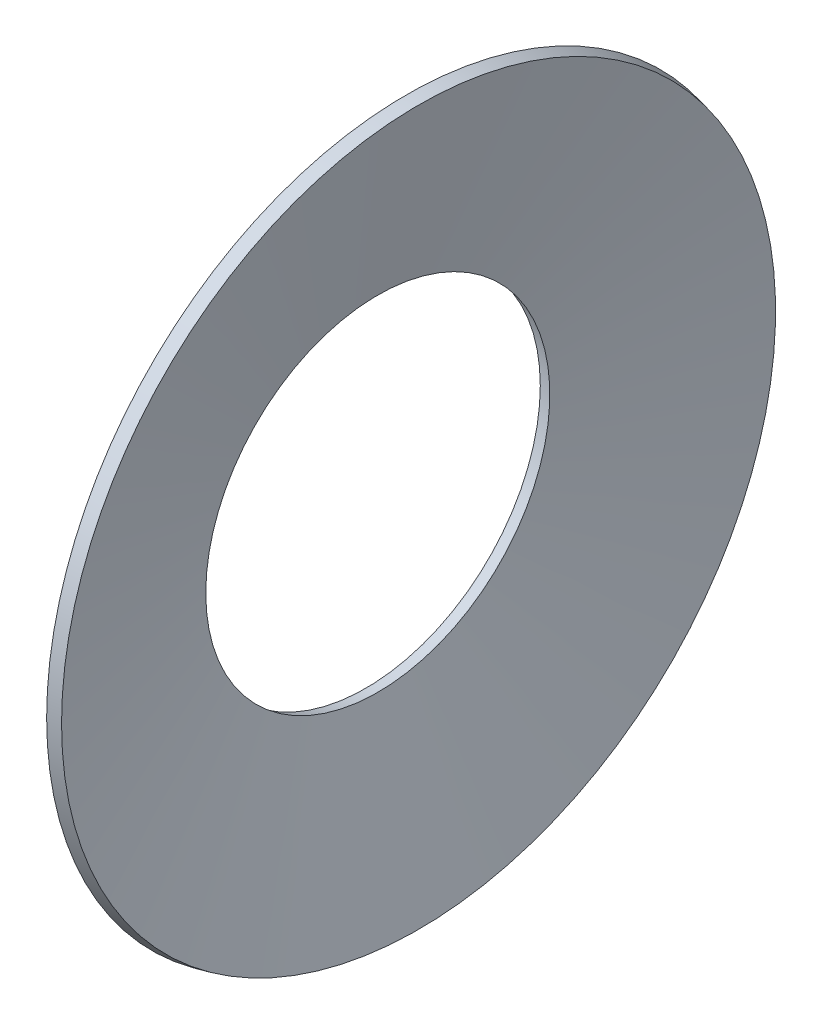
ISO-10303-21;
HEADER;
FILE_DESCRIPTION(('STEP AP214'),'2;1');
FILE_NAME('part.step','',(''),(''),'','','');
FILE_SCHEMA(('AUTOMOTIVE_DESIGN { 1 0 10303 214 1 1 1 1 }'));
ENDSEC;
DATA;
#1=APPLICATION_CONTEXT('core data for automotive mechanical design processes');
#2=APPLICATION_PROTOCOL_DEFINITION('international standard','automotive_design',2000,#1);
#3=PRODUCT_CONTEXT('',#1,'mechanical');
#4=PRODUCT('Part','Part','',(#3));
#5=PRODUCT_RELATED_PRODUCT_CATEGORY('part','',(#4));
#6=PRODUCT_DEFINITION_FORMATION('','',#4);
#7=PRODUCT_DEFINITION_CONTEXT('part definition',#1,'design');
#8=PRODUCT_DEFINITION('design','',#6,#7);
#9=PRODUCT_DEFINITION_SHAPE('','',#8);
#10=(LENGTH_UNIT() NAMED_UNIT(*) SI_UNIT(.MILLI.,.METRE.));
#11=(NAMED_UNIT(*) PLANE_ANGLE_UNIT() SI_UNIT($,.RADIAN.));
#12=(NAMED_UNIT(*) SI_UNIT($,.STERADIAN.) SOLID_ANGLE_UNIT());
#13=UNCERTAINTY_MEASURE_WITH_UNIT(LENGTH_MEASURE(1.E-05),#10,'distance_accuracy_value','');
#14=(GEOMETRIC_REPRESENTATION_CONTEXT(3) GLOBAL_UNCERTAINTY_ASSIGNED_CONTEXT((#13)) GLOBAL_UNIT_ASSIGNED_CONTEXT((#10,
#11,#12)) REPRESENTATION_CONTEXT('',''));
#15=CARTESIAN_POINT('',(0.,0.,0.));
#16=DIRECTION('',(0.,0.,1.));
#17=DIRECTION('',(1.,0.,0.));
#18=AXIS2_PLACEMENT_3D('',#15,#16,#17);
#19=CARTESIAN_POINT('',(1.694,0.,0.));
#20=DIRECTION('',(-1.,0.,0.));
#21=DIRECTION('',(0.,0.,1.));
#22=AXIS2_PLACEMENT_3D('',#19,#20,#21);
#23=CONICAL_SURFACE('',#22,11.4139094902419,0.216923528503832);
#24=CARTESIAN_POINT('',(1.30337431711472,0.,0.));
#25=DIRECTION('',(-1.,0.,0.));
#26=DIRECTION('',(0.,0.,1.));
#27=AXIS2_PLACEMENT_3D('',#24,#25,#26);
#28=CIRCLE('',#27,11.5);
#29=CARTESIAN_POINT('',(1.30337431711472,0.,11.5));
#30=VERTEX_POINT('',#29);
#31=EDGE_CURVE('E39',#30,#30,#28,.T.);
#32=ORIENTED_EDGE('',*,*,#31,.F.);
#33=EDGE_LOOP('',(#32));
#34=FACE_BOUND('',#33,.T.);
#35=CARTESIAN_POINT('',(1.694,0.,0.));
#36=DIRECTION('',(-1.,0.,0.));
#37=DIRECTION('',(0.,0.,1.));
#38=AXIS2_PLACEMENT_3D('',#35,#36,#37);
#39=CIRCLE('',#38,11.4139094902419);
#40=CARTESIAN_POINT('',(1.694,0.,11.4139094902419));
#41=VERTEX_POINT('',#40);
#42=EDGE_CURVE('E10',#41,#41,#39,.T.);
#43=ORIENTED_EDGE('',*,*,#42,.T.);
#44=EDGE_LOOP('',(#43));
#45=FACE_BOUND('',#44,.T.);
#46=ADVANCED_FACE('F25',(#34,#45),#23,.T.);
#47=CARTESIAN_POINT('',(0.390625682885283,0.,0.));
#48=DIRECTION('',(1.,0.,0.));
#49=DIRECTION('',(0.,0.,-1.));
#50=AXIS2_PLACEMENT_3D('',#47,#48,#49);
#51=CONICAL_SURFACE('',#50,5.5,1.35387279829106);
#52=ORIENTED_EDGE('',*,*,#42,.F.);
#53=EDGE_LOOP('',(#52));
#54=FACE_BOUND('',#53,.T.);
#55=CARTESIAN_POINT('',(0.390625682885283,0.,0.));
#56=DIRECTION('',(-1.,0.,0.));
#57=DIRECTION('',(0.,0.,1.));
#58=AXIS2_PLACEMENT_3D('',#55,#56,#57);
#59=CIRCLE('',#58,5.5);
#60=CARTESIAN_POINT('',(0.390625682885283,0.,5.5));
#61=VERTEX_POINT('',#60);
#62=EDGE_CURVE('E31',#61,#61,#59,.T.);
#63=ORIENTED_EDGE('',*,*,#62,.T.);
#64=EDGE_LOOP('',(#63));
#65=FACE_BOUND('',#64,.T.);
#66=ADVANCED_FACE('F48',(#54,#65),#51,.F.);
#67=CARTESIAN_POINT('',(0.,0.,0.));
#68=DIRECTION('',(-1.,0.,0.));
#69=DIRECTION('',(0.,0.,1.));
#70=AXIS2_PLACEMENT_3D('',#67,#68,#69);
#71=CONICAL_SURFACE('',#70,5.58609050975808,0.216923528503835);
#72=ORIENTED_EDGE('',*,*,#62,.F.);
#73=EDGE_LOOP('',(#72));
#74=FACE_BOUND('',#73,.T.);
#75=CARTESIAN_POINT('',(0.,0.,0.));
#76=DIRECTION('',(-1.,0.,0.));
#77=DIRECTION('',(0.,0.,1.));
#78=AXIS2_PLACEMENT_3D('',#75,#76,#77);
#79=CIRCLE('',#78,5.58609050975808);
#80=CARTESIAN_POINT('',(0.,0.,5.58609050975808));
#81=VERTEX_POINT('',#80);
#82=EDGE_CURVE('E35',#81,#81,#79,.T.);
#83=ORIENTED_EDGE('',*,*,#82,.T.);
#84=EDGE_LOOP('',(#83));
#85=FACE_BOUND('',#84,.T.);
#86=ADVANCED_FACE('F52',(#74,#85),#71,.F.);
#87=CARTESIAN_POINT('',(1.30337431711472,0.,0.));
#88=DIRECTION('',(1.,0.,0.));
#89=DIRECTION('',(0.,0.,-1.));
#90=AXIS2_PLACEMENT_3D('',#87,#88,#89);
#91=CONICAL_SURFACE('',#90,11.5,1.35387279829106);
#92=ORIENTED_EDGE('',*,*,#82,.F.);
#93=EDGE_LOOP('',(#92));
#94=FACE_BOUND('',#93,.T.);
#95=ORIENTED_EDGE('',*,*,#31,.T.);
#96=EDGE_LOOP('',(#95));
#97=FACE_BOUND('',#96,.T.);
#98=ADVANCED_FACE('F45',(#94,#97),#91,.T.);
#99=CLOSED_SHELL('',(#46,#66,#86,#98));
#100=MANIFOLD_SOLID_BREP('B2',#99);
#101=ADVANCED_BREP_SHAPE_REPRESENTATION('',(#18,#100),#14);
#102=SHAPE_DEFINITION_REPRESENTATION(#9,#101);
ENDSEC;
END-ISO-10303-21;
